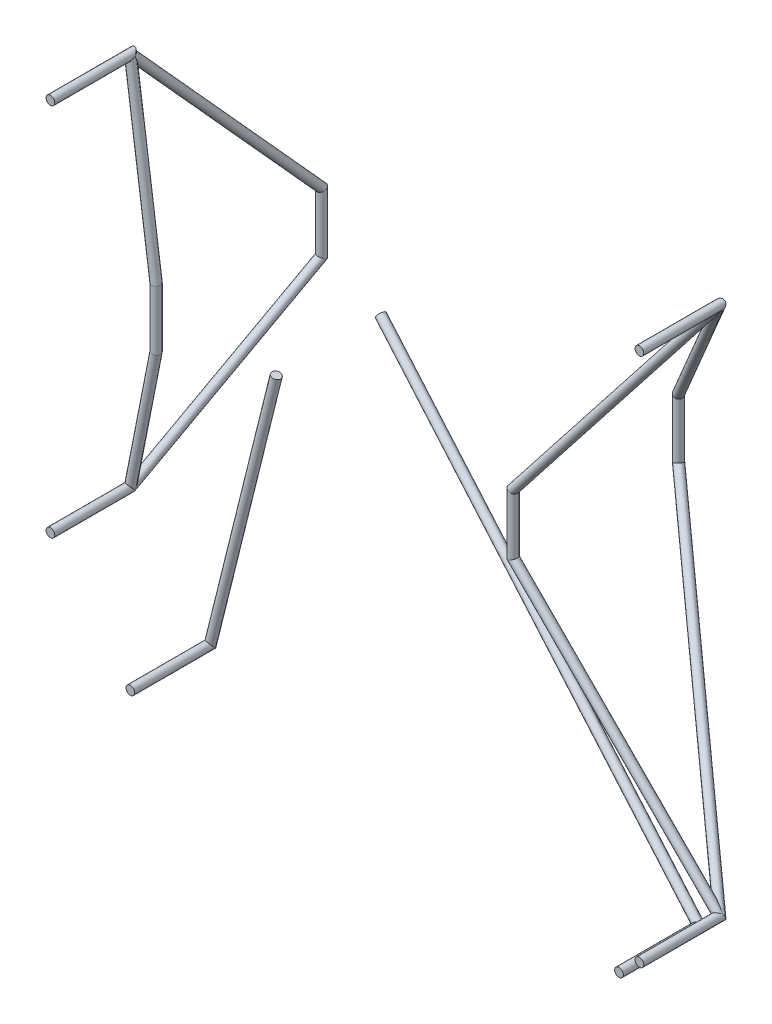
ISO-10303-21;
HEADER;
FILE_DESCRIPTION(('STEP AP214'),'2;1');
FILE_NAME('part.step','',(''),(''),'','','');
FILE_SCHEMA(('AUTOMOTIVE_DESIGN { 1 0 10303 214 1 1 1 1 }'));
ENDSEC;
DATA;
#1=APPLICATION_CONTEXT('core data for automotive mechanical design processes');
#2=APPLICATION_PROTOCOL_DEFINITION('international standard','automotive_design',2000,#1);
#3=PRODUCT_CONTEXT('',#1,'mechanical');
#4=PRODUCT('Part','Part','',(#3));
#5=PRODUCT_RELATED_PRODUCT_CATEGORY('part','',(#4));
#6=PRODUCT_DEFINITION_FORMATION('','',#4);
#7=PRODUCT_DEFINITION_CONTEXT('part definition',#1,'design');
#8=PRODUCT_DEFINITION('design','',#6,#7);
#9=PRODUCT_DEFINITION_SHAPE('','',#8);
#10=(LENGTH_UNIT() NAMED_UNIT(*) SI_UNIT(.MILLI.,.METRE.));
#11=(NAMED_UNIT(*) PLANE_ANGLE_UNIT() SI_UNIT($,.RADIAN.));
#12=(NAMED_UNIT(*) SI_UNIT($,.STERADIAN.) SOLID_ANGLE_UNIT());
#13=UNCERTAINTY_MEASURE_WITH_UNIT(LENGTH_MEASURE(1.E-05),#10,'distance_accuracy_value','');
#14=(GEOMETRIC_REPRESENTATION_CONTEXT(3) GLOBAL_UNCERTAINTY_ASSIGNED_CONTEXT((#13)) GLOBAL_UNIT_ASSIGNED_CONTEXT((#10,
#11,#12)) REPRESENTATION_CONTEXT('',''));
#15=CARTESIAN_POINT('',(0.,0.,0.));
#16=DIRECTION('',(0.,0.,1.));
#17=DIRECTION('',(1.,0.,0.));
#18=AXIS2_PLACEMENT_3D('',#15,#16,#17);
#19=CARTESIAN_POINT('',(890.912042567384,-1034.49663842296,-292.1));
#20=DIRECTION('',(-0.832706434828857,0.511978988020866,-0.210896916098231));
#21=DIRECTION('',(-0.523759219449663,-0.85186635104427,0.));
#22=AXIS2_PLACEMENT_3D('',#19,#20,#21);
#23=CYLINDRICAL_SURFACE('',#22,15.8749999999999);
#24=CARTESIAN_POINT('',(890.912042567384,-1034.49663842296,-292.1));
#25=DIRECTION('',(-0.535085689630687,0.328990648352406,-0.778105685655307));
#26=DIRECTION('',(-0.662842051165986,0.407540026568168,0.628133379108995));
#27=AXIS2_PLACEMENT_3D('',#24,#25,#26);
#28=ELLIPSE('',#27,20.402112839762,15.8749999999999);
#29=CARTESIAN_POINT('',(877.388664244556,-1026.1819608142,-279.284751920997));
#30=VERTEX_POINT('',#29);
#31=EDGE_CURVE('P0_E21',#30,#30,#28,.F.);
#32=ORIENTED_EDGE('',*,*,#31,.F.);
#33=EDGE_LOOP('',(#32));
#34=FACE_BOUND('',#33,.T.);
#35=CARTESIAN_POINT('',(-663.575,-78.7399999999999,-685.8));
#36=DIRECTION('',(-0.832706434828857,0.511978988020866,-0.210896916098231));
#37=DIRECTION('',(-0.523759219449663,-0.85186635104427,0.));
#38=AXIS2_PLACEMENT_3D('',#35,#36,#37);
#39=CIRCLE('',#38,15.8749999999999);
#40=CARTESIAN_POINT('',(-671.889677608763,-92.2633783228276,-685.8));
#41=VERTEX_POINT('',#40);
#42=EDGE_CURVE('P0_E10',#41,#41,#39,.T.);
#43=ORIENTED_EDGE('',*,*,#42,.F.);
#44=EDGE_LOOP('',(#43));
#45=FACE_BOUND('',#44,.T.);
#46=ADVANCED_FACE('P0_F15',(#34,#45),#23,.T.);
#47=CARTESIAN_POINT('',(890.912042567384,-1034.49663842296,0.));
#48=DIRECTION('',(0.,0.,1.));
#49=DIRECTION('',(1.,0.,0.));
#50=AXIS2_PLACEMENT_3D('',#47,#48,#49);
#51=PLANE('',#50);
#52=CARTESIAN_POINT('',(890.912042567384,-1034.49663842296,0.));
#53=DIRECTION('',(0.,0.,1.));
#54=DIRECTION('',(1.,0.,0.));
#55=AXIS2_PLACEMENT_3D('',#52,#53,#54);
#56=CIRCLE('',#55,15.8749999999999);
#57=CARTESIAN_POINT('',(906.787042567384,-1034.49663842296,0.));
#58=VERTEX_POINT('',#57);
#59=EDGE_CURVE('P0_E25',#58,#58,#56,.T.);
#60=ORIENTED_EDGE('',*,*,#59,.T.);
#61=EDGE_LOOP('',(#60));
#62=FACE_BOUND('',#61,.T.);
#63=ADVANCED_FACE('P0_F32',(#62),#51,.T.);
#64=CARTESIAN_POINT('',(890.912042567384,-1034.49663842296,-337.001280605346));
#65=DIRECTION('',(0.,0.,1.));
#66=DIRECTION('',(1.,0.,0.));
#67=AXIS2_PLACEMENT_3D('',#64,#65,#66);
#68=CYLINDRICAL_SURFACE('',#67,15.8749999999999);
#69=ORIENTED_EDGE('',*,*,#59,.F.);
#70=EDGE_LOOP('',(#69));
#71=FACE_BOUND('',#70,.T.);
#72=ORIENTED_EDGE('',*,*,#31,.T.);
#73=EDGE_LOOP('',(#72));
#74=FACE_BOUND('',#73,.T.);
#75=ADVANCED_FACE('P0_F34',(#71,#74),#68,.T.);
#76=CARTESIAN_POINT('',(-663.575,-78.74,-685.8));
#77=DIRECTION('',(-0.832706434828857,0.511978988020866,-0.210896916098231));
#78=DIRECTION('',(-0.523759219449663,-0.85186635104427,0.));
#79=AXIS2_PLACEMENT_3D('',#76,#77,#78);
#80=PLANE('',#79);
#81=ORIENTED_EDGE('',*,*,#42,.T.);
#82=EDGE_LOOP('',(#81));
#83=FACE_BOUND('',#82,.T.);
#84=ADVANCED_FACE('P0_F36',(#83),#80,.T.);
#85=CLOSED_SHELL('',(#46,#63,#75,#84));
#86=MANIFOLD_SOLID_BREP('P0_B1',#85);
#87=CARTESIAN_POINT('',(-890.912042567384,-1034.49663842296,-292.1));
#88=DIRECTION('',(0.231385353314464,0.972776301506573,-0.0129261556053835));
#89=DIRECTION('',(-0.972857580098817,0.231404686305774,0.));
#90=AXIS2_PLACEMENT_3D('',#87,#88,#89);
#91=CYLINDRICAL_SURFACE('',#90,15.8749999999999);
#92=CARTESIAN_POINT('',(-890.912042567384,-1034.49663842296,-292.1));
#93=DIRECTION('',(0.16256684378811,0.683453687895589,-0.711662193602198));
#94=DIRECTION('',(0.164681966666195,0.69234595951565,0.702521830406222));
#95=AXIS2_PLACEMENT_3D('',#92,#93,#94);
#96=ELLIPSE('',#95,22.3069317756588,15.8749999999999);
#97=CARTESIAN_POINT('',(-887.23849317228,-1019.0525243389,-276.428893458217));
#98=VERTEX_POINT('',#97);
#99=EDGE_CURVE('P1_E21',#98,#98,#96,.F.);
#100=ORIENTED_EDGE('',*,*,#99,.F.);
#101=EDGE_LOOP('',(#100));
#102=FACE_BOUND('',#101,.T.);
#103=CARTESIAN_POINT('',(-663.575000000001,-78.74,-304.8));
#104=DIRECTION('',(0.231385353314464,0.972776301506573,-0.0129261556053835));
#105=DIRECTION('',(-0.972857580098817,0.231404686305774,0.));
#106=AXIS2_PLACEMENT_3D('',#103,#104,#105);
#107=CIRCLE('',#106,15.8749999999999);
#108=CARTESIAN_POINT('',(-679.019114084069,-75.0664506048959,-304.8));
#109=VERTEX_POINT('',#108);
#110=EDGE_CURVE('P1_E10',#109,#109,#107,.T.);
#111=ORIENTED_EDGE('',*,*,#110,.F.);
#112=EDGE_LOOP('',(#111));
#113=FACE_BOUND('',#112,.T.);
#114=ADVANCED_FACE('P1_F15',(#102,#113),#91,.T.);
#115=CARTESIAN_POINT('',(-890.912042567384,-1034.49663842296,0.));
#116=DIRECTION('',(0.,0.,1.));
#117=DIRECTION('',(1.,0.,0.));
#118=AXIS2_PLACEMENT_3D('',#115,#116,#117);
#119=PLANE('',#118);
#120=CARTESIAN_POINT('',(-890.912042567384,-1034.49663842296,0.));
#121=DIRECTION('',(0.,0.,1.));
#122=DIRECTION('',(1.,0.,0.));
#123=AXIS2_PLACEMENT_3D('',#120,#121,#122);
#124=CIRCLE('',#123,15.8749999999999);
#125=CARTESIAN_POINT('',(-875.037042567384,-1034.49663842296,0.));
#126=VERTEX_POINT('',#125);
#127=EDGE_CURVE('P1_E25',#126,#126,#124,.T.);
#128=ORIENTED_EDGE('',*,*,#127,.T.);
#129=EDGE_LOOP('',(#128));
#130=FACE_BOUND('',#129,.T.);
#131=ADVANCED_FACE('P1_F32',(#130),#119,.T.);
#132=CARTESIAN_POINT('',(-890.912042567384,-1034.49663842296,-337.001280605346));
#133=DIRECTION('',(0.,0.,1.));
#134=DIRECTION('',(1.,0.,0.));
#135=AXIS2_PLACEMENT_3D('',#132,#133,#134);
#136=CYLINDRICAL_SURFACE('',#135,15.8749999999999);
#137=ORIENTED_EDGE('',*,*,#127,.F.);
#138=EDGE_LOOP('',(#137));
#139=FACE_BOUND('',#138,.T.);
#140=ORIENTED_EDGE('',*,*,#99,.T.);
#141=EDGE_LOOP('',(#140));
#142=FACE_BOUND('',#141,.T.);
#143=ADVANCED_FACE('P1_F34',(#139,#142),#136,.T.);
#144=CARTESIAN_POINT('',(-663.575000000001,-78.74,-304.8));
#145=DIRECTION('',(0.231385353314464,0.972776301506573,-0.0129261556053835));
#146=DIRECTION('',(-0.972857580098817,0.231404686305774,0.));
#147=AXIS2_PLACEMENT_3D('',#144,#145,#146);
#148=PLANE('',#147);
#149=ORIENTED_EDGE('',*,*,#110,.T.);
#150=EDGE_LOOP('',(#149));
#151=FACE_BOUND('',#150,.T.);
#152=ADVANCED_FACE('P1_F36',(#151),#148,.T.);
#153=CLOSED_SHELL('',(#114,#131,#143,#152));
#154=MANIFOLD_SOLID_BREP('P1_B1',#153);
#155=CARTESIAN_POINT('',(965.377533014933,-965.377533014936,-292.1));
#156=DIRECTION('',(0.,0.,1.));
#157=DIRECTION('',(1.,0.,0.));
#158=AXIS2_PLACEMENT_3D('',#155,#156,#157);
#159=CYLINDRICAL_SURFACE('',#158,15.875);
#160=CARTESIAN_POINT('',(965.377533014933,-965.377533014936,0.));
#161=DIRECTION('',(0.,0.,1.));
#162=DIRECTION('',(1.,0.,0.));
#163=AXIS2_PLACEMENT_3D('',#160,#161,#162);
#164=CIRCLE('',#163,15.875);
#165=CARTESIAN_POINT('',(981.252533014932,-965.377533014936,0.));
#166=VERTEX_POINT('',#165);
#167=EDGE_CURVE('P2_E52',#166,#166,#164,.F.);
#168=ORIENTED_EDGE('',*,*,#167,.T.);
#169=EDGE_LOOP('',(#168));
#170=FACE_BOUND('',#169,.T.);
#171=CARTESIAN_POINT('',(965.377533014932,-965.377533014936,-292.1));
#172=DIRECTION('',(0.496180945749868,-0.506735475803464,0.704999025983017));
#173=DIRECTION('',(0.493236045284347,-0.503727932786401,-0.709208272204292));
#174=AXIS2_PLACEMENT_3D('',#171,#172,#173);
#175=ELLIPSE('',#174,22.5177616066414,15.875);
#176=CARTESIAN_POINT('',(954.034707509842,-976.484104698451,-292.100000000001));
#177=VERTEX_POINT('',#176);
#178=CARTESIAN_POINT('',(976.720358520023,-954.27096133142,-292.1));
#179=VERTEX_POINT('',#178);
#180=EDGE_CURVE('P2_E43',#177,#179,#175,.F.);
#181=ORIENTED_EDGE('',*,*,#180,.F.);
#182=CARTESIAN_POINT('',(965.377533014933,-965.377533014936,-292.1));
#183=DIRECTION('',(0.35387675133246,-0.36140425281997,0.862646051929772));
#184=DIRECTION('',(0.60353009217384,-0.616368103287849,-0.505808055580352));
#185=AXIS2_PLACEMENT_3D('',#182,#183,#184);
#186=ELLIPSE('',#185,18.4026808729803,15.875);
#187=EDGE_CURVE('P2_E51',#177,#179,#186,.T.);
#188=ORIENTED_EDGE('',*,*,#187,.T.);
#189=EDGE_LOOP('',(#181,#188));
#190=FACE_BOUND('',#189,.T.);
#191=ADVANCED_FACE('P2_F17',(#170,#190),#159,.T.);
#192=CARTESIAN_POINT('',(219.074999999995,-203.2,-888.999999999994));
#193=DIRECTION('',(0.610540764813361,-0.623527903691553,0.488316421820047));
#194=DIRECTION('',(0.714508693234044,0.699626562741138,0.));
#195=AXIS2_PLACEMENT_3D('',#192,#193,#194);
#196=CYLINDRICAL_SURFACE('',#195,15.875);
#197=CARTESIAN_POINT('',(219.074999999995,-203.2,-888.999999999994));
#198=DIRECTION('',(0.338820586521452,-0.900979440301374,0.270991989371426));
#199=DIRECTION('',(-0.703612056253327,-0.43386178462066,-0.56275574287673));
#200=AXIS2_PLACEMENT_3D('',#197,#198,#199);
#201=ELLIPSE('',#200,17.6197139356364,15.875);
#202=CARTESIAN_POINT('',(206.677556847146,-210.844520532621,-898.915595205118));
#203=VERTEX_POINT('',#202);
#204=EDGE_CURVE('P2_E54',#203,#203,#201,.F.);
#205=ORIENTED_EDGE('',*,*,#204,.F.);
#206=EDGE_LOOP('',(#205));
#207=FACE_BOUND('',#206,.T.);
#208=ORIENTED_EDGE('',*,*,#187,.F.);
#209=CARTESIAN_POINT('',(965.377533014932,-965.377533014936,-292.1));
#210=DIRECTION('',(0.174515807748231,-0.178228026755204,-0.96838990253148));
#211=DIRECTION('',(0.677511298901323,-0.691923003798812,0.249441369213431));
#212=AXIS2_PLACEMENT_3D('',#209,#210,#211);
#213=ELLIPSE('',#212,62.2057400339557,15.875);
#214=EDGE_CURVE('P2_E38',#177,#179,#213,.T.);
#215=ORIENTED_EDGE('',*,*,#214,.T.);
#216=EDGE_LOOP('',(#208,#215));
#217=FACE_BOUND('',#216,.T.);
#218=ADVANCED_FACE('P2_F50',(#207,#217),#196,.T.);
#219=CARTESIAN_POINT('',(219.074999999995,12.7000000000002,-888.999999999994));
#220=DIRECTION('',(0.,-1.,0.));
#221=DIRECTION('',(0.,0.,-1.));
#222=AXIS2_PLACEMENT_3D('',#219,#220,#221);
#223=CYLINDRICAL_SURFACE('',#222,15.875);
#224=CARTESIAN_POINT('',(219.074999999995,12.7000000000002,-888.999999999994));
#225=DIRECTION('',(-0.299414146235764,-0.923581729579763,-0.239474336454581));
#226=DIRECTION('',(-0.721263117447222,0.383401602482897,-0.5768732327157));
#227=AXIS2_PLACEMENT_3D('',#224,#225,#226);
#228=ELLIPSE('',#227,17.188516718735,15.875);
#229=CARTESIAN_POINT('',(206.677556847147,19.2901048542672,-898.915595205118));
#230=VERTEX_POINT('',#229);
#231=EDGE_CURVE('P2_E59',#230,#230,#228,.T.);
#232=ORIENTED_EDGE('',*,*,#231,.T.);
#233=EDGE_LOOP('',(#232));
#234=FACE_BOUND('',#233,.T.);
#235=ORIENTED_EDGE('',*,*,#204,.T.);
#236=EDGE_LOOP('',(#235));
#237=FACE_BOUND('',#236,.T.);
#238=ADVANCED_FACE('P2_F88',(#234,#237),#223,.T.);
#239=CARTESIAN_POINT('',(965.377533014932,965.377533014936,-292.1));
#240=DIRECTION('',(-0.553066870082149,-0.706006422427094,-0.442348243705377));
#241=DIRECTION('',(0.787212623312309,-0.616681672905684,0.));
#242=AXIS2_PLACEMENT_3D('',#239,#240,#241);
#243=CYLINDRICAL_SURFACE('',#242,15.875);
#244=CARTESIAN_POINT('',(965.377533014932,965.377533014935,-292.1));
#245=DIRECTION('',(0.138477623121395,0.176770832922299,-0.974461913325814));
#246=DIRECTION('',(0.600932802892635,0.767108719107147,0.22455284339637));
#247=AXIS2_PLACEMENT_3D('',#244,#245,#246);
#248=ELLIPSE('',#247,69.1230834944,15.875);
#249=CARTESIAN_POINT('',(952.88053261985,975.167354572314,-292.1));
#250=VERTEX_POINT('',#249);
#251=CARTESIAN_POINT('',(977.874533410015,955.587711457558,-292.1));
#252=VERTEX_POINT('',#251);
#253=EDGE_CURVE('P2_E64',#250,#252,#248,.F.);
#254=ORIENTED_EDGE('',*,*,#253,.F.);
#255=CARTESIAN_POINT('',(965.377533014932,965.377533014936,-292.1));
#256=DIRECTION('',(-0.325632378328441,-0.415679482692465,-0.849219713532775));
#257=DIRECTION('',(-0.523698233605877,-0.668516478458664,0.528039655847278));
#258=AXIS2_PLACEMENT_3D('',#255,#256,#257);
#259=ELLIPSE('',#258,18.6936310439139,15.875);
#260=EDGE_CURVE('P2_E174',#252,#250,#259,.F.);
#261=ORIENTED_EDGE('',*,*,#260,.F.);
#262=EDGE_LOOP('',(#254,#261));
#263=FACE_BOUND('',#262,.T.);
#264=ORIENTED_EDGE('',*,*,#231,.F.);
#265=EDGE_LOOP('',(#264));
#266=FACE_BOUND('',#265,.T.);
#267=ADVANCED_FACE('P2_F94',(#263,#266),#243,.T.);
#268=CARTESIAN_POINT('',(965.377533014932,965.377533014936,0.));
#269=DIRECTION('',(0.,0.,1.));
#270=DIRECTION('',(1.,0.,0.));
#271=AXIS2_PLACEMENT_3D('',#268,#269,#270);
#272=PLANE('',#271);
#273=CARTESIAN_POINT('',(965.377533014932,965.377533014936,0.));
#274=DIRECTION('',(0.,0.,1.));
#275=DIRECTION('',(1.,0.,0.));
#276=AXIS2_PLACEMENT_3D('',#273,#274,#275);
#277=CIRCLE('',#276,15.875);
#278=CARTESIAN_POINT('',(981.252533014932,965.377533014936,0.));
#279=VERTEX_POINT('',#278);
#280=EDGE_CURVE('P2_E173',#279,#279,#277,.T.);
#281=ORIENTED_EDGE('',*,*,#280,.T.);
#282=EDGE_LOOP('',(#281));
#283=FACE_BOUND('',#282,.T.);
#284=ADVANCED_FACE('P2_F98',(#283),#272,.T.);
#285=CARTESIAN_POINT('',(965.377533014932,965.377533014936,-337.001280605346));
#286=DIRECTION('',(0.,0.,1.));
#287=DIRECTION('',(1.,0.,0.));
#288=AXIS2_PLACEMENT_3D('',#285,#286,#287);
#289=CYLINDRICAL_SURFACE('',#288,15.875);
#290=ORIENTED_EDGE('',*,*,#280,.F.);
#291=EDGE_LOOP('',(#290));
#292=FACE_BOUND('',#291,.T.);
#293=ORIENTED_EDGE('',*,*,#260,.T.);
#294=CARTESIAN_POINT('',(965.377533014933,965.377533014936,-292.1));
#295=DIRECTION('',(0.437202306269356,0.558101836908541,0.705249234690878));
#296=DIRECTION('',(0.434914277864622,0.555181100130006,-0.7089594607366));
#297=AXIS2_PLACEMENT_3D('',#294,#295,#296);
#298=ELLIPSE('',#297,22.5097727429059,15.875);
#299=EDGE_CURVE('P2_E31',#250,#252,#298,.T.);
#300=ORIENTED_EDGE('',*,*,#299,.T.);
#301=EDGE_LOOP('',(#293,#300));
#302=FACE_BOUND('',#301,.T.);
#303=ADVANCED_FACE('P2_F100',(#292,#302),#289,.T.);
#304=CARTESIAN_POINT('',(965.377533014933,-965.377533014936,0.));
#305=DIRECTION('',(0.,0.,1.));
#306=DIRECTION('',(1.,0.,0.));
#307=AXIS2_PLACEMENT_3D('',#304,#305,#306);
#308=PLANE('',#307);
#309=ORIENTED_EDGE('',*,*,#167,.F.);
#310=EDGE_LOOP('',(#309));
#311=FACE_BOUND('',#310,.T.);
#312=ADVANCED_FACE('P2_F79',(#311),#308,.T.);
#313=CARTESIAN_POINT('',(219.075,12.7,-285.75));
#314=DIRECTION('',(0.6166731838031,0.787201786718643,-0.00524703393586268));
#315=DIRECTION('',(-0.787212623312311,0.616681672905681,0.));
#316=AXIS2_PLACEMENT_3D('',#313,#314,#315);
#317=CYLINDRICAL_SURFACE('',#316,15.875);
#318=CARTESIAN_POINT('',(219.075,12.7,-285.75));
#319=DIRECTION('',(0.326176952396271,0.945304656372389,-0.00277531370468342));
#320=DIRECTION('',(0.945270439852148,-0.326188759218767,-0.00804294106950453));
#321=AXIS2_PLACEMENT_3D('',#318,#319,#320);
#322=ELLIPSE('',#321,16.7935277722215,15.875);
#323=CARTESIAN_POINT('',(234.949425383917,7.22214001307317,-285.885069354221));
#324=VERTEX_POINT('',#323);
#325=EDGE_CURVE('P2_E11',#324,#324,#322,.T.);
#326=ORIENTED_EDGE('',*,*,#325,.T.);
#327=EDGE_LOOP('',(#326));
#328=FACE_BOUND('',#327,.T.);
#329=ORIENTED_EDGE('',*,*,#299,.F.);
#330=ORIENTED_EDGE('',*,*,#253,.T.);
#331=EDGE_LOOP('',(#329,#330));
#332=FACE_BOUND('',#331,.T.);
#333=ADVANCED_FACE('P2_F19',(#328,#332),#317,.T.);
#334=CARTESIAN_POINT('',(219.075,-203.2,-285.75));
#335=DIRECTION('',(0.699614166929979,-0.714496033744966,-0.00595274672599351));
#336=DIRECTION('',(0.714508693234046,0.699626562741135,0.));
#337=AXIS2_PLACEMENT_3D('',#334,#335,#336);
#338=CYLINDRICAL_SURFACE('',#337,15.875);
#339=CARTESIAN_POINT('',(219.075,-203.2,-285.75));
#340=DIRECTION('',(0.377811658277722,-0.925876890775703,-0.00321465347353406));
#341=DIRECTION('',(0.925843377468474,0.377825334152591,-0.00787764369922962));
#342=AXIS2_PLACEMENT_3D('',#339,#340,#341);
#343=ELLIPSE('',#342,17.1459080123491,15.875);
#344=CARTESIAN_POINT('',(234.949425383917,-196.721841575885,-285.885069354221));
#345=VERTEX_POINT('',#344);
#346=EDGE_CURVE('P2_E25',#345,#345,#343,.F.);
#347=ORIENTED_EDGE('',*,*,#346,.F.);
#348=EDGE_LOOP('',(#347));
#349=FACE_BOUND('',#348,.T.);
#350=ORIENTED_EDGE('',*,*,#214,.F.);
#351=ORIENTED_EDGE('',*,*,#180,.T.);
#352=EDGE_LOOP('',(#350,#351));
#353=FACE_BOUND('',#352,.T.);
#354=ADVANCED_FACE('P2_F44',(#349,#353),#338,.T.);
#355=CARTESIAN_POINT('',(219.075,57.6012806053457,-285.75));
#356=DIRECTION('',(0.,-1.,0.));
#357=DIRECTION('',(0.,0.,-1.));
#358=AXIS2_PLACEMENT_3D('',#355,#356,#357);
#359=CYLINDRICAL_SURFACE('',#358,15.875);
#360=ORIENTED_EDGE('',*,*,#325,.F.);
#361=EDGE_LOOP('',(#360));
#362=FACE_BOUND('',#361,.T.);
#363=ORIENTED_EDGE('',*,*,#346,.T.);
#364=EDGE_LOOP('',(#363));
#365=FACE_BOUND('',#364,.T.);
#366=ADVANCED_FACE('P2_F68',(#362,#365),#359,.T.);
#367=CLOSED_SHELL('',(#191,#218,#238,#267,#284,#303,#312,#333,#354,#366));
#368=MANIFOLD_SOLID_BREP('P2_B1',#367);
#369=CARTESIAN_POINT('',(-1182.3411825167,-682.625000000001,-292.1));
#370=DIRECTION('',(0.,0.,1.));
#371=DIRECTION('',(1.,0.,0.));
#372=AXIS2_PLACEMENT_3D('',#369,#370,#371);
#373=CYLINDRICAL_SURFACE('',#372,15.875);
#374=CARTESIAN_POINT('',(-1182.3411825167,-682.625000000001,0.));
#375=DIRECTION('',(0.,0.,1.));
#376=DIRECTION('',(1.,0.,0.));
#377=AXIS2_PLACEMENT_3D('',#374,#375,#376);
#378=CIRCLE('',#377,15.875);
#379=CARTESIAN_POINT('',(-1166.4661825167,-682.625000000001,0.));
#380=VERTEX_POINT('',#379);
#381=EDGE_CURVE('P3_E52',#380,#380,#378,.T.);
#382=ORIENTED_EDGE('',*,*,#381,.F.);
#383=EDGE_LOOP('',(#382));
#384=FACE_BOUND('',#383,.T.);
#385=CARTESIAN_POINT('',(-1182.3411825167,-682.625000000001,-292.1));
#386=DIRECTION('',(-0.144851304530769,-0.696779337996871,0.702507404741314));
#387=DIRECTION('',(0.142985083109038,0.687802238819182,0.71167643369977));
#388=AXIS2_PLACEMENT_3D('',#385,#386,#387);
#389=ELLIPSE('',#388,22.5976265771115,15.875);
#390=CARTESIAN_POINT('',(-1197.88388066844,-679.393876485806,-292.1));
#391=VERTEX_POINT('',#390);
#392=CARTESIAN_POINT('',(-1166.79848436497,-685.856123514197,-292.1));
#393=VERTEX_POINT('',#392);
#394=EDGE_CURVE('P3_E43',#391,#393,#389,.F.);
#395=ORIENTED_EDGE('',*,*,#394,.F.);
#396=CARTESIAN_POINT('',(-1182.3411825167,-682.625000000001,-292.1));
#397=DIRECTION('',(-0.0685509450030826,-0.329751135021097,0.941575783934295));
#398=DIRECTION('',(-0.191643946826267,-0.921866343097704,-0.336801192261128));
#399=AXIS2_PLACEMENT_3D('',#396,#397,#398);
#400=ELLIPSE('',#399,16.8600342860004,15.875);
#401=EDGE_CURVE('P3_E48',#393,#391,#400,.F.);
#402=ORIENTED_EDGE('',*,*,#401,.F.);
#403=EDGE_LOOP('',(#395,#402));
#404=FACE_BOUND('',#403,.T.);
#405=ADVANCED_FACE('P3_F17',(#384,#404),#373,.T.);
#406=CARTESIAN_POINT('',(-1082.675,-203.2,-889.));
#407=DIRECTION('',(-0.129091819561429,-0.620971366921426,0.773129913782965));
#408=DIRECTION('',(0.,-0.779653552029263,-0.626211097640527));
#409=AXIS2_PLACEMENT_3D('',#406,#407,#408);
#410=CYLINDRICAL_SURFACE('',#409,15.875);
#411=CARTESIAN_POINT('',(-1082.675,-203.2,-889.));
#412=DIRECTION('',(-0.0716961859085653,-0.900269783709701,0.429387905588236));
#413=DIRECTION('',(0.148268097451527,-0.435332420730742,-0.887976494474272));
#414=AXIS2_PLACEMENT_3D('',#411,#412,#413);
#415=ELLIPSE('',#414,17.6336030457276,15.875);
#416=CARTESIAN_POINT('',(-1080.06049922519,-210.876479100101,-904.658225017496));
#417=VERTEX_POINT('',#416);
#418=EDGE_CURVE('P3_E53',#417,#417,#415,.T.);
#419=ORIENTED_EDGE('',*,*,#418,.T.);
#420=EDGE_LOOP('',(#419));
#421=FACE_BOUND('',#420,.T.);
#422=ORIENTED_EDGE('',*,*,#401,.T.);
#423=CARTESIAN_POINT('',(-1182.3411825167,-682.625000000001,-292.1));
#424=DIRECTION('',(0.0858451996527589,0.412941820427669,0.90670262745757));
#425=DIRECTION('',(-0.184546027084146,-0.887723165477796,0.42177048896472));
#426=AXIS2_PLACEMENT_3D('',#423,#424,#425);
#427=ELLIPSE('',#426,36.6212093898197,15.875);
#428=EDGE_CURVE('P3_E11',#391,#393,#427,.F.);
#429=ORIENTED_EDGE('',*,*,#428,.T.);
#430=EDGE_LOOP('',(#422,#429));
#431=FACE_BOUND('',#430,.T.);
#432=ADVANCED_FACE('P3_F51',(#421,#431),#410,.T.);
#433=CARTESIAN_POINT('',(-1182.3411825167,682.625000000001,-292.1));
#434=DIRECTION('',(0.110398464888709,-0.742064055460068,-0.661175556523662));
#435=DIRECTION('',(0.,0.665241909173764,-0.746627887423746));
#436=AXIS2_PLACEMENT_3D('',#433,#434,#435);
#437=CYLINDRICAL_SURFACE('',#436,15.875);
#438=CARTESIAN_POINT('',(-1082.675,12.7000000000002,-889.));
#439=DIRECTION('',(0.0591447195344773,-0.933290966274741,-0.354217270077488));
#440=DIRECTION('',(0.153706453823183,0.35912111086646,-0.920546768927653));
#441=AXIS2_PLACEMENT_3D('',#438,#439,#440);
#442=ELLIPSE('',#441,17.0097006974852,15.875);
#443=CARTESIAN_POINT('',(-1080.0604992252,18.808542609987,-904.658225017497));
#444=VERTEX_POINT('',#443);
#445=EDGE_CURVE('P3_E58',#444,#444,#442,.T.);
#446=ORIENTED_EDGE('',*,*,#445,.F.);
#447=EDGE_LOOP('',(#446));
#448=FACE_BOUND('',#447,.T.);
#449=CARTESIAN_POINT('',(-1182.3411825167,682.625000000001,-292.1));
#450=DIRECTION('',(0.137899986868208,-0.926920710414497,-0.349000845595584));
#451=DIRECTION('',(-0.0513563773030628,0.345201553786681,-0.937122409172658));
#452=AXIS2_PLACEMENT_3D('',#449,#450,#451);
#453=ELLIPSE('',#452,17.0002587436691,15.875);
#454=CARTESIAN_POINT('',(-1166.63900088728,684.961047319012,-292.1));
#455=VERTEX_POINT('',#454);
#456=CARTESIAN_POINT('',(-1198.04336414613,680.28895268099,-292.1));
#457=VERTEX_POINT('',#456);
#458=EDGE_CURVE('P3_E30',#455,#457,#453,.F.);
#459=ORIENTED_EDGE('',*,*,#458,.F.);
#460=CARTESIAN_POINT('',(-1182.3411825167,682.625000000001,-292.1));
#461=DIRECTION('',(-0.0513563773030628,0.345201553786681,-0.937122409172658));
#462=DIRECTION('',(0.137899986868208,-0.926920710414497,-0.349000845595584));
#463=AXIS2_PLACEMENT_3D('',#460,#461,#462);
#464=ELLIPSE('',#463,44.3719461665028,15.875);
#465=EDGE_CURVE('P3_E34',#457,#455,#464,.F.);
#466=ORIENTED_EDGE('',*,*,#465,.F.);
#467=EDGE_LOOP('',(#459,#466));
#468=FACE_BOUND('',#467,.T.);
#469=ADVANCED_FACE('P3_F84',(#448,#468),#437,.T.);
#470=CARTESIAN_POINT('',(-1082.675,12.7000000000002,-889.));
#471=DIRECTION('',(0.,-1.,0.));
#472=DIRECTION('',(1.,0.,0.));
#473=AXIS2_PLACEMENT_3D('',#470,#471,#472);
#474=CYLINDRICAL_SURFACE('',#473,15.875);
#475=ORIENTED_EDGE('',*,*,#445,.T.);
#476=EDGE_LOOP('',(#475));
#477=FACE_BOUND('',#476,.T.);
#478=ORIENTED_EDGE('',*,*,#418,.F.);
#479=EDGE_LOOP('',(#478));
#480=FACE_BOUND('',#479,.T.);
#481=ADVANCED_FACE('P3_F81',(#477,#480),#474,.T.);
#482=CARTESIAN_POINT('',(-1182.3411825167,-682.625000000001,0.));
#483=DIRECTION('',(0.,0.,1.));
#484=DIRECTION('',(1.,0.,0.));
#485=AXIS2_PLACEMENT_3D('',#482,#483,#484);
#486=PLANE('',#485);
#487=ORIENTED_EDGE('',*,*,#381,.T.);
#488=EDGE_LOOP('',(#487));
#489=FACE_BOUND('',#488,.T.);
#490=ADVANCED_FACE('P3_F93',(#489),#486,.T.);
#491=CARTESIAN_POINT('',(-1082.675,-203.2,-285.75));
#492=DIRECTION('',(-0.20351822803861,-0.978985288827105,-0.0129666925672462));
#493=DIRECTION('',(0.979067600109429,-0.203535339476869,0.));
#494=AXIS2_PLACEMENT_3D('',#491,#492,#493);
#495=CYLINDRICAL_SURFACE('',#494,15.875);
#496=CARTESIAN_POINT('',(-1082.675,-203.2,-285.75));
#497=DIRECTION('',(-0.102297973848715,-0.994732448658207,-0.00651767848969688));
#498=DIRECTION('',(0.99271961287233,-0.102505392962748,0.0632488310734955));
#499=AXIS2_PLACEMENT_3D('',#496,#497,#498);
#500=ELLIPSE('',#499,15.9590651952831,15.875);
#501=CARTESIAN_POINT('',(-1066.83212297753,-204.835890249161,-284.740607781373));
#502=VERTEX_POINT('',#501);
#503=EDGE_CURVE('P3_E69',#502,#502,#500,.F.);
#504=ORIENTED_EDGE('',*,*,#503,.F.);
#505=EDGE_LOOP('',(#504));
#506=FACE_BOUND('',#505,.T.);
#507=ORIENTED_EDGE('',*,*,#428,.F.);
#508=ORIENTED_EDGE('',*,*,#394,.T.);
#509=EDGE_LOOP('',(#507,#508));
#510=FACE_BOUND('',#509,.T.);
#511=ADVANCED_FACE('P3_F42',(#506,#510),#495,.T.);
#512=CARTESIAN_POINT('',(-1082.675,12.7,-285.75));
#513=DIRECTION('',(0.,-1.,0.));
#514=DIRECTION('',(0.,0.,-1.));
#515=AXIS2_PLACEMENT_3D('',#512,#513,#514);
#516=CYLINDRICAL_SURFACE('',#515,15.875);
#517=CARTESIAN_POINT('',(-1082.675,12.7,-285.75));
#518=DIRECTION('',(0.0737749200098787,-0.997263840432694,0.00470039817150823));
#519=DIRECTION('',(0.99524588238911,0.0739245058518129,0.0634097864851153));
#520=AXIS2_PLACEMENT_3D('',#517,#518,#519);
#521=ELLIPSE('',#520,15.9185557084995,15.875);
#522=CARTESIAN_POINT('',(-1066.83212297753,13.8767713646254,-284.740607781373));
#523=VERTEX_POINT('',#522);
#524=EDGE_CURVE('P3_E73',#523,#523,#521,.T.);
#525=ORIENTED_EDGE('',*,*,#524,.T.);
#526=EDGE_LOOP('',(#525));
#527=FACE_BOUND('',#526,.T.);
#528=ORIENTED_EDGE('',*,*,#503,.T.);
#529=EDGE_LOOP('',(#528));
#530=FACE_BOUND('',#529,.T.);
#531=ADVANCED_FACE('P3_F110',(#527,#530),#516,.T.);
#532=CARTESIAN_POINT('',(-1182.3411825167,682.625000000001,-292.1));
#533=DIRECTION('',(0.147146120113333,-0.989070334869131,0.00937507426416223));
#534=DIRECTION('',(0.989113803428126,0.147152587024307,0.));
#535=AXIS2_PLACEMENT_3D('',#532,#533,#534);
#536=CYLINDRICAL_SURFACE('',#535,15.875);
#537=ORIENTED_EDGE('',*,*,#524,.F.);
#538=EDGE_LOOP('',(#537));
#539=FACE_BOUND('',#538,.T.);
#540=CARTESIAN_POINT('',(-1182.3411825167,682.625000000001,-292.1));
#541=DIRECTION('',(-0.10453920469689,0.702679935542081,0.703784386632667));
#542=DIRECTION('',(0.103563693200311,-0.696122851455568,0.710413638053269));
#543=AXIS2_PLACEMENT_3D('',#540,#541,#542);
#544=ELLIPSE('',#543,22.556624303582,15.875);
#545=EDGE_CURVE('P3_E24',#457,#455,#544,.T.);
#546=ORIENTED_EDGE('',*,*,#545,.F.);
#547=ORIENTED_EDGE('',*,*,#465,.T.);
#548=EDGE_LOOP('',(#546,#547));
#549=FACE_BOUND('',#548,.T.);
#550=ADVANCED_FACE('P3_F68',(#539,#549),#536,.T.);
#551=CARTESIAN_POINT('',(-1182.3411825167,682.625000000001,-292.1));
#552=DIRECTION('',(0.104539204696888,-0.702679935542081,-0.703784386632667));
#553=DIRECTION('',(0.103563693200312,-0.696122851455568,0.710413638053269));
#554=AXIS2_PLACEMENT_3D('',#551,#552,#553);
#555=ELLIPSE('',#554,22.556624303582,15.875);
#556=EDGE_CURVE('P3_E66',#455,#457,#555,.F.);
#557=ORIENTED_EDGE('',*,*,#556,.F.);
#558=ORIENTED_EDGE('',*,*,#458,.T.);
#559=EDGE_LOOP('',(#557,#558));
#560=FACE_BOUND('',#559,.T.);
#561=ADVANCED_FACE('P3_F117',(#560),#536,.T.);
#562=CARTESIAN_POINT('',(-1182.3411825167,682.625000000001,0.));
#563=DIRECTION('',(0.,0.,1.));
#564=DIRECTION('',(1.,0.,0.));
#565=AXIS2_PLACEMENT_3D('',#562,#563,#564);
#566=PLANE('',#565);
#567=CARTESIAN_POINT('',(-1182.3411825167,682.625000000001,0.));
#568=DIRECTION('',(0.,0.,1.));
#569=DIRECTION('',(1.,0.,0.));
#570=AXIS2_PLACEMENT_3D('',#567,#568,#569);
#571=CIRCLE('',#570,15.875);
#572=CARTESIAN_POINT('',(-1166.4661825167,682.625000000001,0.));
#573=VERTEX_POINT('',#572);
#574=EDGE_CURVE('P3_E49',#573,#573,#571,.T.);
#575=ORIENTED_EDGE('',*,*,#574,.T.);
#576=EDGE_LOOP('',(#575));
#577=FACE_BOUND('',#576,.T.);
#578=ADVANCED_FACE('P3_F115',(#577),#566,.T.);
#579=CARTESIAN_POINT('',(-1182.3411825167,682.625000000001,-337.001280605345));
#580=DIRECTION('',(0.,0.,1.));
#581=DIRECTION('',(1.,0.,0.));
#582=AXIS2_PLACEMENT_3D('',#579,#580,#581);
#583=CYLINDRICAL_SURFACE('',#582,15.875);
#584=ORIENTED_EDGE('',*,*,#574,.F.);
#585=EDGE_LOOP('',(#584));
#586=FACE_BOUND('',#585,.T.);
#587=ORIENTED_EDGE('',*,*,#545,.T.);
#588=ORIENTED_EDGE('',*,*,#556,.T.);
#589=EDGE_LOOP('',(#587,#588));
#590=FACE_BOUND('',#589,.T.);
#591=ADVANCED_FACE('P3_F65',(#586,#590),#583,.T.);
#592=CLOSED_SHELL('',(#405,#432,#469,#481,#490,#511,#531,#550,#561,#578,#591));
#593=MANIFOLD_SOLID_BREP('P3_B1',#592);
#594=ADVANCED_BREP_SHAPE_REPRESENTATION('',(#18,#86,#154,#368,#593),#14);
#595=SHAPE_DEFINITION_REPRESENTATION(#9,#594);
ENDSEC;
END-ISO-10303-21;
